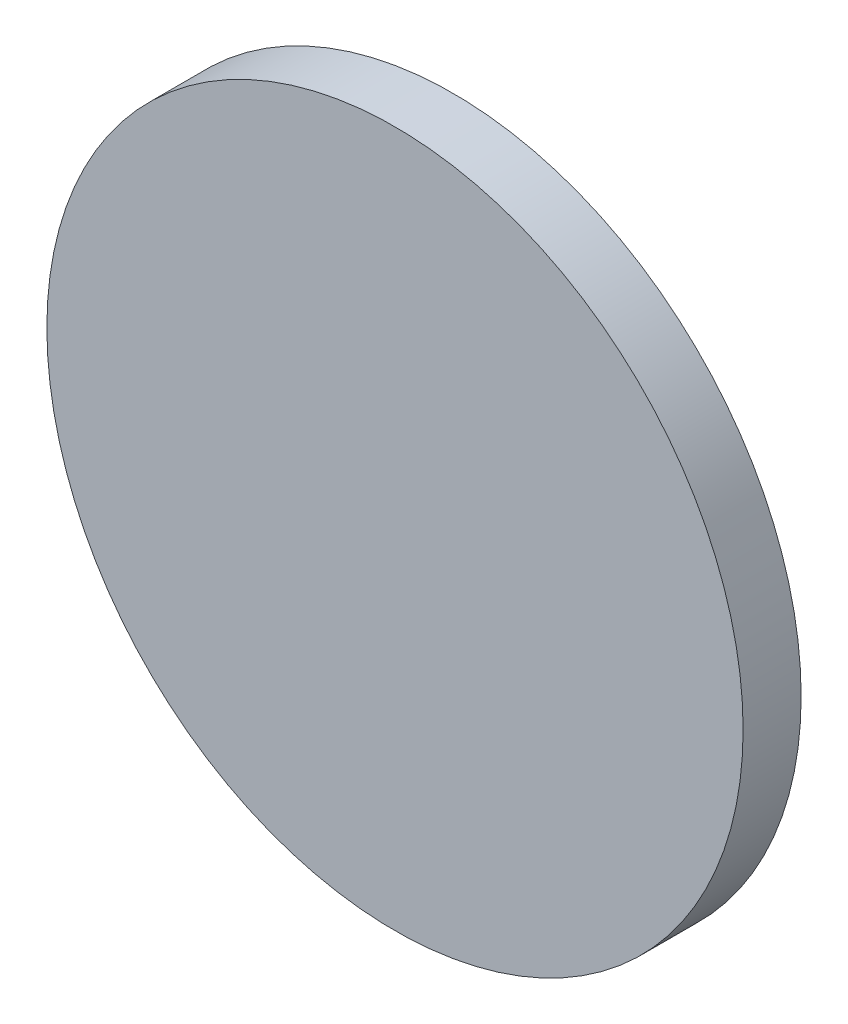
ISO-10303-21;
HEADER;
FILE_DESCRIPTION(('STEP AP214'),'2;1');
FILE_NAME('part.step','',(''),(''),'','','');
FILE_SCHEMA(('AUTOMOTIVE_DESIGN { 1 0 10303 214 1 1 1 1 }'));
ENDSEC;
DATA;
#1=APPLICATION_CONTEXT('core data for automotive mechanical design processes');
#2=APPLICATION_PROTOCOL_DEFINITION('international standard','automotive_design',2000,#1);
#3=PRODUCT_CONTEXT('',#1,'mechanical');
#4=PRODUCT('Part','Part','',(#3));
#5=PRODUCT_RELATED_PRODUCT_CATEGORY('part','',(#4));
#6=PRODUCT_DEFINITION_FORMATION('','',#4);
#7=PRODUCT_DEFINITION_CONTEXT('part definition',#1,'design');
#8=PRODUCT_DEFINITION('design','',#6,#7);
#9=PRODUCT_DEFINITION_SHAPE('','',#8);
#10=(LENGTH_UNIT() NAMED_UNIT(*) SI_UNIT(.MILLI.,.METRE.));
#11=(NAMED_UNIT(*) PLANE_ANGLE_UNIT() SI_UNIT($,.RADIAN.));
#12=(NAMED_UNIT(*) SI_UNIT($,.STERADIAN.) SOLID_ANGLE_UNIT());
#13=UNCERTAINTY_MEASURE_WITH_UNIT(LENGTH_MEASURE(1.E-05),#10,'distance_accuracy_value','');
#14=(GEOMETRIC_REPRESENTATION_CONTEXT(3) GLOBAL_UNCERTAINTY_ASSIGNED_CONTEXT((#13)) GLOBAL_UNIT_ASSIGNED_CONTEXT((#10,
#11,#12)) REPRESENTATION_CONTEXT('',''));
#15=CARTESIAN_POINT('',(0.,0.,0.));
#16=DIRECTION('',(0.,0.,1.));
#17=DIRECTION('',(1.,0.,0.));
#18=AXIS2_PLACEMENT_3D('',#15,#16,#17);
#19=CARTESIAN_POINT('',(-2.1665544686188,-6.36148435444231,0.1));
#20=DIRECTION('',(0.,0.,1.));
#21=DIRECTION('',(1.,0.,0.));
#22=AXIS2_PLACEMENT_3D('',#19,#20,#21);
#23=PLANE('',#22);
#24=CARTESIAN_POINT('',(-2.1665544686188,-6.36148435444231,0.1));
#25=DIRECTION('',(0.,0.,1.));
#26=DIRECTION('',(1.,0.,0.));
#27=AXIS2_PLACEMENT_3D('',#24,#25,#26);
#28=CIRCLE('',#27,0.6);
#29=CARTESIAN_POINT('',(-1.5665544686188,-6.36148435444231,0.1));
#30=VERTEX_POINT('',#29);
#31=EDGE_CURVE('E17',#30,#30,#28,.F.);
#32=ORIENTED_EDGE('',*,*,#31,.F.);
#33=EDGE_LOOP('',(#32));
#34=FACE_BOUND('',#33,.T.);
#35=ADVANCED_FACE('F13',(#34),#23,.T.);
#36=CARTESIAN_POINT('',(-2.1665544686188,-6.36148435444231,0.));
#37=DIRECTION('',(0.,0.,1.));
#38=DIRECTION('',(1.,0.,0.));
#39=AXIS2_PLACEMENT_3D('',#36,#37,#38);
#40=CYLINDRICAL_SURFACE('',#39,0.6);
#41=CARTESIAN_POINT('',(-2.1665544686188,-6.36148435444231,0.));
#42=DIRECTION('',(0.,0.,1.));
#43=DIRECTION('',(1.,0.,0.));
#44=AXIS2_PLACEMENT_3D('',#41,#42,#43);
#45=CIRCLE('',#44,0.6);
#46=CARTESIAN_POINT('',(-1.5665544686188,-6.36148435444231,0.));
#47=VERTEX_POINT('',#46);
#48=EDGE_CURVE('E9',#47,#47,#45,.T.);
#49=ORIENTED_EDGE('',*,*,#48,.T.);
#50=EDGE_LOOP('',(#49));
#51=FACE_BOUND('',#50,.T.);
#52=ORIENTED_EDGE('',*,*,#31,.T.);
#53=EDGE_LOOP('',(#52));
#54=FACE_BOUND('',#53,.T.);
#55=ADVANCED_FACE('F26',(#51,#54),#40,.T.);
#56=CARTESIAN_POINT('',(-2.1665544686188,-6.36148435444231,0.));
#57=DIRECTION('',(0.,0.,1.));
#58=DIRECTION('',(1.,0.,0.));
#59=AXIS2_PLACEMENT_3D('',#56,#57,#58);
#60=PLANE('',#59);
#61=ORIENTED_EDGE('',*,*,#48,.F.);
#62=EDGE_LOOP('',(#61));
#63=FACE_BOUND('',#62,.T.);
#64=ADVANCED_FACE('F15',(#63),#60,.F.);
#65=CLOSED_SHELL('',(#35,#55,#64));
#66=MANIFOLD_SOLID_BREP('B1',#65);
#67=ADVANCED_BREP_SHAPE_REPRESENTATION('',(#18,#66),#14);
#68=SHAPE_DEFINITION_REPRESENTATION(#9,#67);
ENDSEC;
END-ISO-10303-21;
